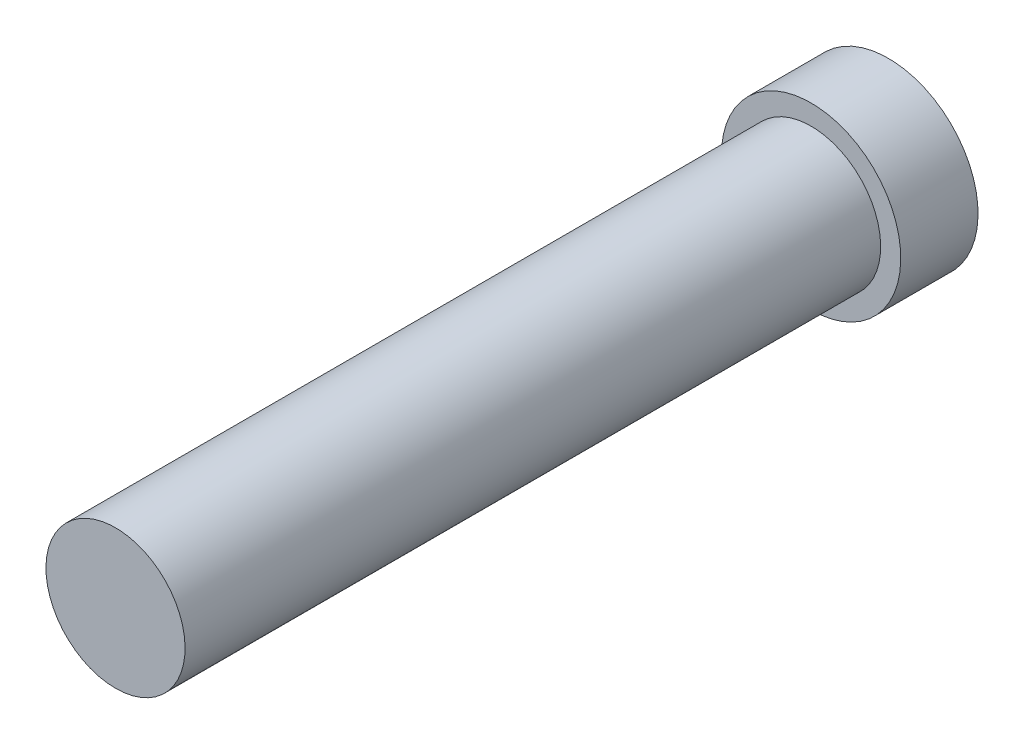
ISO-10303-21;
HEADER;
FILE_DESCRIPTION(('STEP AP214'),'2;1');
FILE_NAME('part.step','',(''),(''),'','','');
FILE_SCHEMA(('AUTOMOTIVE_DESIGN { 1 0 10303 214 1 1 1 1 }'));
ENDSEC;
DATA;
#1=APPLICATION_CONTEXT('core data for automotive mechanical design processes');
#2=APPLICATION_PROTOCOL_DEFINITION('international standard','automotive_design',2000,#1);
#3=PRODUCT_CONTEXT('',#1,'mechanical');
#4=PRODUCT('Part','Part','',(#3));
#5=PRODUCT_RELATED_PRODUCT_CATEGORY('part','',(#4));
#6=PRODUCT_DEFINITION_FORMATION('','',#4);
#7=PRODUCT_DEFINITION_CONTEXT('part definition',#1,'design');
#8=PRODUCT_DEFINITION('design','',#6,#7);
#9=PRODUCT_DEFINITION_SHAPE('','',#8);
#10=(LENGTH_UNIT() NAMED_UNIT(*) SI_UNIT(.MILLI.,.METRE.));
#11=(NAMED_UNIT(*) PLANE_ANGLE_UNIT() SI_UNIT($,.RADIAN.));
#12=(NAMED_UNIT(*) SI_UNIT($,.STERADIAN.) SOLID_ANGLE_UNIT());
#13=UNCERTAINTY_MEASURE_WITH_UNIT(LENGTH_MEASURE(1.E-05),#10,'distance_accuracy_value','');
#14=(GEOMETRIC_REPRESENTATION_CONTEXT(3) GLOBAL_UNCERTAINTY_ASSIGNED_CONTEXT((#13)) GLOBAL_UNIT_ASSIGNED_CONTEXT((#10,
#11,#12)) REPRESENTATION_CONTEXT('',''));
#15=CARTESIAN_POINT('',(0.,0.,0.));
#16=DIRECTION('',(0.,0.,1.));
#17=DIRECTION('',(1.,0.,0.));
#18=AXIS2_PLACEMENT_3D('',#15,#16,#17);
#19=CARTESIAN_POINT('',(0.,0.,-25.));
#20=DIRECTION('',(0.,0.,1.));
#21=DIRECTION('',(0.,-1.,0.));
#22=AXIS2_PLACEMENT_3D('',#19,#20,#21);
#23=PLANE('',#22);
#24=DIRECTION('',(-0.866025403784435,-0.500000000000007,0.));
#25=VECTOR('',#24,1.);
#26=CARTESIAN_POINT('',(1.34903810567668,-2.33660254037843,-25.));
#27=LINE('',#26,#25);
#28=CARTESIAN_POINT('',(0.,-3.11547005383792,-25.));
#29=VERTEX_POINT('',#28);
#30=CARTESIAN_POINT('',(2.69807621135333,-1.55773502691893,-25.));
#31=VERTEX_POINT('',#30);
#32=EDGE_CURVE('E184',#29,#31,#27,.F.);
#33=ORIENTED_EDGE('',*,*,#32,.T.);
#34=DIRECTION('',(0.,-1.,0.));
#35=VECTOR('',#34,1.);
#36=CARTESIAN_POINT('',(2.69807621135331,0.,-25.));
#37=LINE('',#36,#35);
#38=CARTESIAN_POINT('',(2.6980762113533,1.557735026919,-25.));
#39=VERTEX_POINT('',#38);
#40=EDGE_CURVE('E148',#31,#39,#37,.F.);
#41=ORIENTED_EDGE('',*,*,#40,.T.);
#42=DIRECTION('',(0.866025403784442,-0.499999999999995,0.));
#43=VECTOR('',#42,1.);
#44=CARTESIAN_POINT('',(1.34903810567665,2.33660254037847,-25.));
#45=LINE('',#44,#43);
#46=CARTESIAN_POINT('',(0.,3.11547005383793,-25.));
#47=VERTEX_POINT('',#46);
#48=EDGE_CURVE('E164',#39,#47,#45,.F.);
#49=ORIENTED_EDGE('',*,*,#48,.T.);
#50=DIRECTION('',(0.866025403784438,0.500000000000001,0.));
#51=VECTOR('',#50,1.);
#52=CARTESIAN_POINT('',(-1.34903810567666,2.33660254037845,-25.));
#53=LINE('',#52,#51);
#54=CARTESIAN_POINT('',(-2.69807621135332,1.55773502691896,-25.));
#55=VERTEX_POINT('',#54);
#56=EDGE_CURVE('E169',#47,#55,#53,.F.);
#57=ORIENTED_EDGE('',*,*,#56,.T.);
#58=DIRECTION('',(0.,1.,0.));
#59=VECTOR('',#58,1.);
#60=CARTESIAN_POINT('',(-2.69807621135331,0.,-25.));
#61=LINE('',#60,#59);
#62=CARTESIAN_POINT('',(-2.69807621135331,-1.55773502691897,-25.));
#63=VERTEX_POINT('',#62);
#64=EDGE_CURVE('E178',#55,#63,#61,.F.);
#65=ORIENTED_EDGE('',*,*,#64,.T.);
#66=DIRECTION('',(-0.866025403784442,0.499999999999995,0.));
#67=VECTOR('',#66,1.);
#68=CARTESIAN_POINT('',(-1.34903810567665,-2.33660254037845,-25.));
#69=LINE('',#68,#67);
#70=EDGE_CURVE('E181',#63,#29,#69,.F.);
#71=ORIENTED_EDGE('',*,*,#70,.T.);
#72=EDGE_LOOP('',(#33,#41,#49,#57,#65,#71));
#73=FACE_BOUND('',#72,.T.);
#74=CARTESIAN_POINT('',(0.,0.,-25.));
#75=DIRECTION('',(0.,0.,1.));
#76=DIRECTION('',(0.,-1.,0.));
#77=AXIS2_PLACEMENT_3D('',#74,#75,#76);
#78=CIRCLE('',#77,5.8);
#79=CARTESIAN_POINT('',(0.,-5.79999999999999,-25.));
#80=VERTEX_POINT('',#79);
#81=EDGE_CURVE('E165',#80,#80,#78,.T.);
#82=ORIENTED_EDGE('',*,*,#81,.F.);
#83=EDGE_LOOP('',(#82));
#84=FACE_BOUND('',#83,.T.);
#85=ADVANCED_FACE('F39',(#73,#84),#23,.F.);
#86=CARTESIAN_POINT('',(0.,0.,25.));
#87=DIRECTION('',(0.,0.,1.));
#88=DIRECTION('',(0.,-1.,0.));
#89=AXIS2_PLACEMENT_3D('',#86,#87,#88);
#90=CYLINDRICAL_SURFACE('',#89,5.8);
#91=CARTESIAN_POINT('',(0.,0.,-20.));
#92=DIRECTION('',(0.,0.,1.));
#93=DIRECTION('',(0.,-1.,0.));
#94=AXIS2_PLACEMENT_3D('',#91,#92,#93);
#95=CIRCLE('',#94,5.8);
#96=CARTESIAN_POINT('',(0.,-5.79999999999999,-20.));
#97=VERTEX_POINT('',#96);
#98=EDGE_CURVE('E172',#97,#97,#95,.T.);
#99=ORIENTED_EDGE('',*,*,#98,.F.);
#100=EDGE_LOOP('',(#99));
#101=FACE_BOUND('',#100,.T.);
#102=ORIENTED_EDGE('',*,*,#81,.T.);
#103=EDGE_LOOP('',(#102));
#104=FACE_BOUND('',#103,.T.);
#105=ADVANCED_FACE('F337',(#101,#104),#90,.T.);
#106=CARTESIAN_POINT('',(0.,5.80000000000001,-20.));
#107=DIRECTION('',(0.,0.,-1.));
#108=DIRECTION('',(0.,1.,0.));
#109=AXIS2_PLACEMENT_3D('',#106,#107,#108);
#110=PLANE('',#109);
#111=CARTESIAN_POINT('',(0.,0.,-20.));
#112=DIRECTION('',(0.,0.,1.));
#113=DIRECTION('',(0.,-1.,0.));
#114=AXIS2_PLACEMENT_3D('',#111,#112,#113);
#115=CIRCLE('',#114,4.49999999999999);
#116=CARTESIAN_POINT('',(0.,-4.49999999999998,-20.));
#117=VERTEX_POINT('',#116);
#118=EDGE_CURVE('E321',#117,#117,#115,.T.);
#119=ORIENTED_EDGE('',*,*,#118,.F.);
#120=EDGE_LOOP('',(#119));
#121=FACE_BOUND('',#120,.T.);
#122=ORIENTED_EDGE('',*,*,#98,.T.);
#123=EDGE_LOOP('',(#122));
#124=FACE_BOUND('',#123,.T.);
#125=ADVANCED_FACE('F335',(#121,#124),#110,.F.);
#126=CARTESIAN_POINT('',(0.,0.,25.));
#127=DIRECTION('',(0.,0.,1.));
#128=DIRECTION('',(0.,-1.,0.));
#129=AXIS2_PLACEMENT_3D('',#126,#127,#128);
#130=CYLINDRICAL_SURFACE('',#129,4.49999999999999);
#131=CARTESIAN_POINT('',(0.,0.,25.));
#132=DIRECTION('',(0.,0.,1.));
#133=DIRECTION('',(0.,-1.,0.));
#134=AXIS2_PLACEMENT_3D('',#131,#132,#133);
#135=CIRCLE('',#134,4.49999999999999);
#136=CARTESIAN_POINT('',(0.,-4.49999999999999,25.));
#137=VERTEX_POINT('',#136);
#138=EDGE_CURVE('E316',#137,#137,#135,.T.);
#139=ORIENTED_EDGE('',*,*,#138,.F.);
#140=EDGE_LOOP('',(#139));
#141=FACE_BOUND('',#140,.T.);
#142=ORIENTED_EDGE('',*,*,#118,.T.);
#143=EDGE_LOOP('',(#142));
#144=FACE_BOUND('',#143,.T.);
#145=ADVANCED_FACE('F458',(#141,#144),#130,.T.);
#146=CARTESIAN_POINT('',(0.,4.49999999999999,25.));
#147=DIRECTION('',(0.,0.,-1.));
#148=DIRECTION('',(0.,1.,0.));
#149=AXIS2_PLACEMENT_3D('',#146,#147,#148);
#150=PLANE('',#149);
#151=ORIENTED_EDGE('',*,*,#138,.T.);
#152=EDGE_LOOP('',(#151));
#153=FACE_BOUND('',#152,.T.);
#154=ADVANCED_FACE('F451',(#153),#150,.F.);
#155=CARTESIAN_POINT('',(-2.59807621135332,1.5,-22.));
#156=DIRECTION('',(-1.,0.,0.));
#157=DIRECTION('',(0.,-1.,0.));
#158=AXIS2_PLACEMENT_3D('',#155,#156,#157);
#159=PLANE('',#158);
#160=DIRECTION('',(0.,0.,-1.));
#161=VECTOR('',#160,1.);
#162=CARTESIAN_POINT('',(-2.59807621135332,1.5,-22.));
#163=LINE('',#162,#161);
#164=CARTESIAN_POINT('',(-2.59807621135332,1.5,-22.1));
#165=VERTEX_POINT('',#164);
#166=CARTESIAN_POINT('',(-2.59807621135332,1.5,-24.9));
#167=VERTEX_POINT('',#166);
#168=EDGE_CURVE('E220',#165,#167,#163,.T.);
#169=ORIENTED_EDGE('',*,*,#168,.F.);
#170=DIRECTION('',(0.,1.,0.));
#171=VECTOR('',#170,1.);
#172=CARTESIAN_POINT('',(-2.59807621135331,-1.50000000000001,-22.1));
#173=LINE('',#172,#171);
#174=CARTESIAN_POINT('',(-2.59807621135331,-1.50000000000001,-22.1));
#175=VERTEX_POINT('',#174);
#176=EDGE_CURVE('E243',#165,#175,#173,.F.);
#177=ORIENTED_EDGE('',*,*,#176,.T.);
#178=DIRECTION('',(0.,0.,-1.));
#179=VECTOR('',#178,1.);
#180=CARTESIAN_POINT('',(-2.59807621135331,-1.50000000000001,-22.));
#181=LINE('',#180,#179);
#182=CARTESIAN_POINT('',(-2.59807621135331,-1.50000000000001,-24.9));
#183=VERTEX_POINT('',#182);
#184=EDGE_CURVE('E311',#175,#183,#181,.T.);
#185=ORIENTED_EDGE('',*,*,#184,.T.);
#186=DIRECTION('',(0.,1.,0.));
#187=VECTOR('',#186,1.);
#188=CARTESIAN_POINT('',(-2.59807621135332,1.5,-24.9));
#189=LINE('',#188,#187);
#190=EDGE_CURVE('E192',#183,#167,#189,.T.);
#191=ORIENTED_EDGE('',*,*,#190,.T.);
#192=EDGE_LOOP('',(#169,#177,#185,#191));
#193=FACE_BOUND('',#192,.T.);
#194=ADVANCED_FACE('F310',(#193),#159,.F.);
#195=CARTESIAN_POINT('',(-2.59807621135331,-1.50000000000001,-22.));
#196=DIRECTION('',(-0.499999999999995,-0.866025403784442,0.));
#197=DIRECTION('',(0.866025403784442,-0.499999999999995,0.));
#198=AXIS2_PLACEMENT_3D('',#195,#196,#197);
#199=PLANE('',#198);
#200=ORIENTED_EDGE('',*,*,#184,.F.);
#201=DIRECTION('',(-0.866025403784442,0.499999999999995,0.));
#202=VECTOR('',#201,1.);
#203=CARTESIAN_POINT('',(0.,-3.,-22.1));
#204=LINE('',#203,#202);
#205=CARTESIAN_POINT('',(0.,-3.,-22.1));
#206=VERTEX_POINT('',#205);
#207=EDGE_CURVE('E246',#175,#206,#204,.F.);
#208=ORIENTED_EDGE('',*,*,#207,.T.);
#209=DIRECTION('',(0.,0.,-1.));
#210=VECTOR('',#209,1.);
#211=CARTESIAN_POINT('',(0.,-3.,-22.));
#212=LINE('',#211,#210);
#213=CARTESIAN_POINT('',(0.,-3.,-24.9));
#214=VERTEX_POINT('',#213);
#215=EDGE_CURVE('E137',#206,#214,#212,.T.);
#216=ORIENTED_EDGE('',*,*,#215,.T.);
#217=DIRECTION('',(-0.866025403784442,0.499999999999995,0.));
#218=VECTOR('',#217,1.);
#219=CARTESIAN_POINT('',(-2.59807621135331,-1.50000000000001,-24.9));
#220=LINE('',#219,#218);
#221=EDGE_CURVE('E159',#214,#183,#220,.T.);
#222=ORIENTED_EDGE('',*,*,#221,.T.);
#223=EDGE_LOOP('',(#200,#208,#216,#222));
#224=FACE_BOUND('',#223,.T.);
#225=ADVANCED_FACE('F313',(#224),#199,.F.);
#226=CARTESIAN_POINT('',(0.,-3.,-22.));
#227=DIRECTION('',(0.500000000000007,-0.866025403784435,0.));
#228=DIRECTION('',(0.866025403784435,0.500000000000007,0.));
#229=AXIS2_PLACEMENT_3D('',#226,#227,#228);
#230=PLANE('',#229);
#231=ORIENTED_EDGE('',*,*,#215,.F.);
#232=DIRECTION('',(-0.866025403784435,-0.500000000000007,0.));
#233=VECTOR('',#232,1.);
#234=CARTESIAN_POINT('',(2.59807621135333,-1.49999999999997,-22.1));
#235=LINE('',#234,#233);
#236=CARTESIAN_POINT('',(2.59807621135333,-1.49999999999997,-22.1));
#237=VERTEX_POINT('',#236);
#238=EDGE_CURVE('E64',#206,#237,#235,.F.);
#239=ORIENTED_EDGE('',*,*,#238,.T.);
#240=DIRECTION('',(0.,0.,-1.));
#241=VECTOR('',#240,1.);
#242=CARTESIAN_POINT('',(2.59807621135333,-1.49999999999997,-22.));
#243=LINE('',#242,#241);
#244=CARTESIAN_POINT('',(2.59807621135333,-1.49999999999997,-24.9));
#245=VERTEX_POINT('',#244);
#246=EDGE_CURVE('E128',#237,#245,#243,.T.);
#247=ORIENTED_EDGE('',*,*,#246,.T.);
#248=DIRECTION('',(-0.866025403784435,-0.500000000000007,0.));
#249=VECTOR('',#248,1.);
#250=CARTESIAN_POINT('',(0.,-3.,-24.9));
#251=LINE('',#250,#249);
#252=EDGE_CURVE('E132',#245,#214,#251,.T.);
#253=ORIENTED_EDGE('',*,*,#252,.T.);
#254=EDGE_LOOP('',(#231,#239,#247,#253));
#255=FACE_BOUND('',#254,.T.);
#256=ADVANCED_FACE('F130',(#255),#230,.F.);
#257=CARTESIAN_POINT('',(2.59807621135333,-1.49999999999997,-22.));
#258=DIRECTION('',(1.,0.,0.));
#259=DIRECTION('',(0.,1.,0.));
#260=AXIS2_PLACEMENT_3D('',#257,#258,#259);
#261=PLANE('',#260);
#262=ORIENTED_EDGE('',*,*,#246,.F.);
#263=DIRECTION('',(0.,-1.,0.));
#264=VECTOR('',#263,1.);
#265=CARTESIAN_POINT('',(2.5980762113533,1.50000000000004,-22.1));
#266=LINE('',#265,#264);
#267=CARTESIAN_POINT('',(2.5980762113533,1.50000000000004,-22.1));
#268=VERTEX_POINT('',#267);
#269=EDGE_CURVE('E49',#237,#268,#266,.F.);
#270=ORIENTED_EDGE('',*,*,#269,.T.);
#271=DIRECTION('',(0.,0.,-1.));
#272=VECTOR('',#271,1.);
#273=CARTESIAN_POINT('',(2.5980762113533,1.50000000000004,-22.));
#274=LINE('',#273,#272);
#275=CARTESIAN_POINT('',(2.5980762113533,1.50000000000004,-24.9));
#276=VERTEX_POINT('',#275);
#277=EDGE_CURVE('E138',#268,#276,#274,.T.);
#278=ORIENTED_EDGE('',*,*,#277,.T.);
#279=DIRECTION('',(0.,-1.,0.));
#280=VECTOR('',#279,1.);
#281=CARTESIAN_POINT('',(2.59807621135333,-1.49999999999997,-24.9));
#282=LINE('',#281,#280);
#283=EDGE_CURVE('E146',#276,#245,#282,.T.);
#284=ORIENTED_EDGE('',*,*,#283,.T.);
#285=EDGE_LOOP('',(#262,#270,#278,#284));
#286=FACE_BOUND('',#285,.T.);
#287=ADVANCED_FACE('F161',(#286),#261,.F.);
#288=CARTESIAN_POINT('',(2.5980762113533,1.50000000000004,-22.));
#289=DIRECTION('',(0.499999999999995,0.866025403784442,0.));
#290=DIRECTION('',(-0.866025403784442,0.499999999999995,0.));
#291=AXIS2_PLACEMENT_3D('',#288,#289,#290);
#292=PLANE('',#291);
#293=ORIENTED_EDGE('',*,*,#277,.F.);
#294=DIRECTION('',(0.866025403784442,-0.499999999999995,0.));
#295=VECTOR('',#294,1.);
#296=CARTESIAN_POINT('',(0.,3.00000000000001,-22.1));
#297=LINE('',#296,#295);
#298=CARTESIAN_POINT('',(0.,3.00000000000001,-22.1));
#299=VERTEX_POINT('',#298);
#300=EDGE_CURVE('E11',#268,#299,#297,.F.);
#301=ORIENTED_EDGE('',*,*,#300,.T.);
#302=DIRECTION('',(0.,0.,-1.));
#303=VECTOR('',#302,1.);
#304=CARTESIAN_POINT('',(0.,3.00000000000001,-22.));
#305=LINE('',#304,#303);
#306=CARTESIAN_POINT('',(0.,3.00000000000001,-24.9));
#307=VERTEX_POINT('',#306);
#308=EDGE_CURVE('E291',#299,#307,#305,.T.);
#309=ORIENTED_EDGE('',*,*,#308,.T.);
#310=DIRECTION('',(0.866025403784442,-0.499999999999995,0.));
#311=VECTOR('',#310,1.);
#312=CARTESIAN_POINT('',(2.5980762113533,1.50000000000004,-24.9));
#313=LINE('',#312,#311);
#314=EDGE_CURVE('E200',#307,#276,#313,.T.);
#315=ORIENTED_EDGE('',*,*,#314,.T.);
#316=EDGE_LOOP('',(#293,#301,#309,#315));
#317=FACE_BOUND('',#316,.T.);
#318=ADVANCED_FACE('F290',(#317),#292,.F.);
#319=CARTESIAN_POINT('',(0.,3.00000000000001,-22.));
#320=DIRECTION('',(-0.500000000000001,0.866025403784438,0.));
#321=DIRECTION('',(-0.866025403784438,-0.500000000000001,0.));
#322=AXIS2_PLACEMENT_3D('',#319,#320,#321);
#323=PLANE('',#322);
#324=ORIENTED_EDGE('',*,*,#308,.F.);
#325=DIRECTION('',(0.866025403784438,0.500000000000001,0.));
#326=VECTOR('',#325,1.);
#327=CARTESIAN_POINT('',(-2.59807621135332,1.5,-22.1));
#328=LINE('',#327,#326);
#329=EDGE_CURVE('E239',#299,#165,#328,.F.);
#330=ORIENTED_EDGE('',*,*,#329,.T.);
#331=ORIENTED_EDGE('',*,*,#168,.T.);
#332=DIRECTION('',(0.866025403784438,0.500000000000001,0.));
#333=VECTOR('',#332,1.);
#334=CARTESIAN_POINT('',(0.,3.00000000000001,-24.9));
#335=LINE('',#334,#333);
#336=EDGE_CURVE('E196',#167,#307,#335,.T.);
#337=ORIENTED_EDGE('',*,*,#336,.T.);
#338=EDGE_LOOP('',(#324,#330,#331,#337));
#339=FACE_BOUND('',#338,.T.);
#340=ADVANCED_FACE('F294',(#339),#323,.F.);
#341=CARTESIAN_POINT('',(0.,0.,-22.));
#342=DIRECTION('',(0.,0.,1.));
#343=DIRECTION('',(1.,0.,0.));
#344=AXIS2_PLACEMENT_3D('',#341,#342,#343);
#345=PLANE('',#344);
#346=DIRECTION('',(0.,1.,0.));
#347=VECTOR('',#346,1.);
#348=CARTESIAN_POINT('',(-2.49807621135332,1.5,-22.));
#349=LINE('',#348,#347);
#350=CARTESIAN_POINT('',(-2.49807621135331,-1.44226497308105,-22.));
#351=VERTEX_POINT('',#350);
#352=CARTESIAN_POINT('',(-2.49807621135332,1.44226497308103,-22.));
#353=VERTEX_POINT('',#352);
#354=EDGE_CURVE('E232',#351,#353,#349,.T.);
#355=ORIENTED_EDGE('',*,*,#354,.T.);
#356=DIRECTION('',(0.866025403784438,0.500000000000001,0.));
#357=VECTOR('',#356,1.);
#358=CARTESIAN_POINT('',(0.0500000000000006,2.91339745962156,-22.));
#359=LINE('',#358,#357);
#360=CARTESIAN_POINT('',(0.,2.88452994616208,-22.));
#361=VERTEX_POINT('',#360);
#362=EDGE_CURVE('E235',#353,#361,#359,.T.);
#363=ORIENTED_EDGE('',*,*,#362,.T.);
#364=DIRECTION('',(0.866025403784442,-0.499999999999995,0.));
#365=VECTOR('',#364,1.);
#366=CARTESIAN_POINT('',(2.5480762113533,1.41339745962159,-22.));
#367=LINE('',#366,#365);
#368=CARTESIAN_POINT('',(2.4980762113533,1.44226497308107,-22.));
#369=VERTEX_POINT('',#368);
#370=EDGE_CURVE('E202',#361,#369,#367,.T.);
#371=ORIENTED_EDGE('',*,*,#370,.T.);
#372=DIRECTION('',(0.,-1.,0.));
#373=VECTOR('',#372,1.);
#374=CARTESIAN_POINT('',(2.49807621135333,-1.49999999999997,-22.));
#375=LINE('',#374,#373);
#376=CARTESIAN_POINT('',(2.49807621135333,-1.44226497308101,-22.));
#377=VERTEX_POINT('',#376);
#378=EDGE_CURVE('E223',#369,#377,#375,.T.);
#379=ORIENTED_EDGE('',*,*,#378,.T.);
#380=DIRECTION('',(-0.866025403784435,-0.500000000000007,0.));
#381=VECTOR('',#380,1.);
#382=CARTESIAN_POINT('',(-0.04999999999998,-2.91339745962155,-22.));
#383=LINE('',#382,#381);
#384=CARTESIAN_POINT('',(0.,-2.88452994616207,-22.));
#385=VERTEX_POINT('',#384);
#386=EDGE_CURVE('E226',#377,#385,#383,.T.);
#387=ORIENTED_EDGE('',*,*,#386,.T.);
#388=DIRECTION('',(-0.866025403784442,0.499999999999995,0.));
#389=VECTOR('',#388,1.);
#390=CARTESIAN_POINT('',(-2.54807621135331,-1.41339745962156,-22.));
#391=LINE('',#390,#389);
#392=EDGE_CURVE('E229',#385,#351,#391,.T.);
#393=ORIENTED_EDGE('',*,*,#392,.T.);
#394=EDGE_LOOP('',(#355,#363,#371,#379,#387,#393));
#395=FACE_BOUND('',#394,.T.);
#396=ADVANCED_FACE('F369',(#395),#345,.F.);
#397=CARTESIAN_POINT('',(-2.69807621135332,1.5,-24.9));
#398=DIRECTION('',(0.,1.,0.));
#399=DIRECTION('',(-1.,0.,0.));
#400=AXIS2_PLACEMENT_3D('',#397,#398,#399);
#401=CYLINDRICAL_SURFACE('',#400,0.1);
#402=CARTESIAN_POINT('',(-2.69807621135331,-1.55773502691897,-24.9));
#403=DIRECTION('',(-0.500000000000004,0.866025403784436,0.));
#404=DIRECTION('',(-0.866025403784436,-0.500000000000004,0.));
#405=AXIS2_PLACEMENT_3D('',#402,#403,#404);
#406=ELLIPSE('',#405,0.115470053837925,0.1);
#407=EDGE_CURVE('E212',#63,#183,#406,.F.);
#408=ORIENTED_EDGE('',*,*,#407,.F.);
#409=ORIENTED_EDGE('',*,*,#64,.F.);
#410=CARTESIAN_POINT('',(-2.69807621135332,1.55773502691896,-24.9));
#411=DIRECTION('',(0.499999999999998,0.86602540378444,0.));
#412=DIRECTION('',(-0.86602540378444,0.499999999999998,0.));
#413=AXIS2_PLACEMENT_3D('',#410,#411,#412);
#414=ELLIPSE('',#413,0.115470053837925,0.1);
#415=EDGE_CURVE('E216',#167,#55,#414,.T.);
#416=ORIENTED_EDGE('',*,*,#415,.F.);
#417=ORIENTED_EDGE('',*,*,#190,.F.);
#418=EDGE_LOOP('',(#408,#409,#416,#417));
#419=FACE_BOUND('',#418,.T.);
#420=ADVANCED_FACE('F365',(#419),#401,.T.);
#421=CARTESIAN_POINT('',(-0.0499999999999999,3.08660254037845,-24.9));
#422=DIRECTION('',(0.866025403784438,0.500000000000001,0.));
#423=DIRECTION('',(-0.500000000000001,0.866025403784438,0.));
#424=AXIS2_PLACEMENT_3D('',#421,#422,#423);
#425=CYLINDRICAL_SURFACE('',#424,0.1);
#426=ORIENTED_EDGE('',*,*,#415,.T.);
#427=ORIENTED_EDGE('',*,*,#56,.F.);
#428=CARTESIAN_POINT('',(0.,3.11547005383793,-24.9));
#429=DIRECTION('',(1.,0.,0.));
#430=DIRECTION('',(0.,1.,0.));
#431=AXIS2_PLACEMENT_3D('',#428,#429,#430);
#432=ELLIPSE('',#431,0.115470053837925,0.1);
#433=EDGE_CURVE('E208',#307,#47,#432,.T.);
#434=ORIENTED_EDGE('',*,*,#433,.F.);
#435=ORIENTED_EDGE('',*,*,#336,.F.);
#436=EDGE_LOOP('',(#426,#427,#434,#435));
#437=FACE_BOUND('',#436,.T.);
#438=ADVANCED_FACE('F361',(#437),#425,.T.);
#439=CARTESIAN_POINT('',(-2.64807621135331,-1.58660254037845,-24.9));
#440=DIRECTION('',(-0.866025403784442,0.499999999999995,0.));
#441=DIRECTION('',(-0.499999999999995,-0.866025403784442,0.));
#442=AXIS2_PLACEMENT_3D('',#439,#440,#441);
#443=CYLINDRICAL_SURFACE('',#442,0.1);
#444=ORIENTED_EDGE('',*,*,#407,.T.);
#445=ORIENTED_EDGE('',*,*,#221,.F.);
#446=CARTESIAN_POINT('',(0.,-3.11547005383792,-24.9));
#447=DIRECTION('',(-1.,0.,0.));
#448=DIRECTION('',(0.,-1.,0.));
#449=AXIS2_PLACEMENT_3D('',#446,#447,#448);
#450=ELLIPSE('',#449,0.115470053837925,0.1);
#451=EDGE_CURVE('E157',#29,#214,#450,.F.);
#452=ORIENTED_EDGE('',*,*,#451,.F.);
#453=ORIENTED_EDGE('',*,*,#70,.F.);
#454=EDGE_LOOP('',(#444,#445,#452,#453));
#455=FACE_BOUND('',#454,.T.);
#456=ADVANCED_FACE('F357',(#455),#443,.T.);
#457=CARTESIAN_POINT('',(2.6480762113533,1.58660254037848,-24.9));
#458=DIRECTION('',(0.866025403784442,-0.499999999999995,0.));
#459=DIRECTION('',(0.499999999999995,0.866025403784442,0.));
#460=AXIS2_PLACEMENT_3D('',#457,#458,#459);
#461=CYLINDRICAL_SURFACE('',#460,0.1);
#462=ORIENTED_EDGE('',*,*,#433,.T.);
#463=ORIENTED_EDGE('',*,*,#48,.F.);
#464=CARTESIAN_POINT('',(2.6980762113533,1.557735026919,-24.9));
#465=DIRECTION('',(0.500000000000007,-0.866025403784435,0.));
#466=DIRECTION('',(-0.866025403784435,-0.500000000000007,0.));
#467=AXIS2_PLACEMENT_3D('',#464,#465,#466);
#468=ELLIPSE('',#467,0.115470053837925,0.1);
#469=EDGE_CURVE('E152',#276,#39,#468,.T.);
#470=ORIENTED_EDGE('',*,*,#469,.F.);
#471=ORIENTED_EDGE('',*,*,#314,.F.);
#472=EDGE_LOOP('',(#462,#463,#470,#471));
#473=FACE_BOUND('',#472,.T.);
#474=ADVANCED_FACE('F354',(#473),#461,.T.);
#475=CARTESIAN_POINT('',(0.0500000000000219,-3.08660254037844,-24.9));
#476=DIRECTION('',(-0.866025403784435,-0.500000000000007,0.));
#477=DIRECTION('',(0.500000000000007,-0.866025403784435,0.));
#478=AXIS2_PLACEMENT_3D('',#475,#476,#477);
#479=CYLINDRICAL_SURFACE('',#478,0.1);
#480=ORIENTED_EDGE('',*,*,#451,.T.);
#481=ORIENTED_EDGE('',*,*,#252,.F.);
#482=CARTESIAN_POINT('',(2.69807621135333,-1.55773502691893,-24.9));
#483=DIRECTION('',(-0.499999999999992,-0.866025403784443,0.));
#484=DIRECTION('',(0.866025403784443,-0.499999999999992,0.));
#485=AXIS2_PLACEMENT_3D('',#482,#483,#484);
#486=ELLIPSE('',#485,0.115470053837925,0.1);
#487=EDGE_CURVE('E144',#31,#245,#486,.F.);
#488=ORIENTED_EDGE('',*,*,#487,.F.);
#489=ORIENTED_EDGE('',*,*,#32,.F.);
#490=EDGE_LOOP('',(#480,#481,#488,#489));
#491=FACE_BOUND('',#490,.T.);
#492=ADVANCED_FACE('F155',(#491),#479,.T.);
#493=CARTESIAN_POINT('',(2.69807621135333,-1.49999999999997,-24.9));
#494=DIRECTION('',(0.,-1.,0.));
#495=DIRECTION('',(1.,0.,0.));
#496=AXIS2_PLACEMENT_3D('',#493,#494,#495);
#497=CYLINDRICAL_SURFACE('',#496,0.1);
#498=ORIENTED_EDGE('',*,*,#469,.T.);
#499=ORIENTED_EDGE('',*,*,#40,.F.);
#500=ORIENTED_EDGE('',*,*,#487,.T.);
#501=ORIENTED_EDGE('',*,*,#283,.F.);
#502=EDGE_LOOP('',(#498,#499,#500,#501));
#503=FACE_BOUND('',#502,.T.);
#504=ADVANCED_FACE('F145',(#503),#497,.T.);
#505=CARTESIAN_POINT('',(1.24903810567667,-2.16339745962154,-22.1));
#506=DIRECTION('',(0.866025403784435,0.500000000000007,0.));
#507=DIRECTION('',(-0.500000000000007,0.866025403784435,0.));
#508=AXIS2_PLACEMENT_3D('',#505,#506,#507);
#509=CYLINDRICAL_SURFACE('',#508,0.1);
#510=CARTESIAN_POINT('',(2.49807621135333,-1.44226497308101,-22.1));
#511=DIRECTION('',(0.499999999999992,0.866025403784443,0.));
#512=DIRECTION('',(0.866025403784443,-0.499999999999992,0.));
#513=AXIS2_PLACEMENT_3D('',#510,#511,#512);
#514=ELLIPSE('',#513,0.115470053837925,0.1);
#515=EDGE_CURVE('E266',#237,#377,#514,.F.);
#516=ORIENTED_EDGE('',*,*,#515,.F.);
#517=ORIENTED_EDGE('',*,*,#238,.F.);
#518=CARTESIAN_POINT('',(0.,-2.88452994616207,-22.1));
#519=DIRECTION('',(1.,0.,0.));
#520=DIRECTION('',(0.,-1.,0.));
#521=AXIS2_PLACEMENT_3D('',#518,#519,#520);
#522=ELLIPSE('',#521,0.115470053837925,0.1);
#523=EDGE_CURVE('E43',#385,#206,#522,.T.);
#524=ORIENTED_EDGE('',*,*,#523,.F.);
#525=ORIENTED_EDGE('',*,*,#386,.F.);
#526=EDGE_LOOP('',(#516,#517,#524,#525));
#527=FACE_BOUND('',#526,.T.);
#528=ADVANCED_FACE('F41',(#527),#509,.F.);
#529=CARTESIAN_POINT('',(-1.24903810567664,-2.16339745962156,-22.1));
#530=DIRECTION('',(0.866025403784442,-0.499999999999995,0.));
#531=DIRECTION('',(0.499999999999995,0.866025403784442,0.));
#532=AXIS2_PLACEMENT_3D('',#529,#530,#531);
#533=CYLINDRICAL_SURFACE('',#532,0.1);
#534=ORIENTED_EDGE('',*,*,#523,.T.);
#535=ORIENTED_EDGE('',*,*,#207,.F.);
#536=CARTESIAN_POINT('',(-2.49807621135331,-1.44226497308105,-22.1));
#537=DIRECTION('',(0.500000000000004,-0.866025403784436,0.));
#538=DIRECTION('',(-0.866025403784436,-0.500000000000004,0.));
#539=AXIS2_PLACEMENT_3D('',#536,#537,#538);
#540=ELLIPSE('',#539,0.115470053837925,0.1);
#541=EDGE_CURVE('E263',#351,#175,#540,.T.);
#542=ORIENTED_EDGE('',*,*,#541,.F.);
#543=ORIENTED_EDGE('',*,*,#392,.F.);
#544=EDGE_LOOP('',(#534,#535,#542,#543));
#545=FACE_BOUND('',#544,.T.);
#546=ADVANCED_FACE('F277',(#545),#533,.F.);
#547=CARTESIAN_POINT('',(2.49807621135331,0.,-22.1));
#548=DIRECTION('',(0.,1.,0.));
#549=DIRECTION('',(-1.,0.,0.));
#550=AXIS2_PLACEMENT_3D('',#547,#548,#549);
#551=CYLINDRICAL_SURFACE('',#550,0.1);
#552=ORIENTED_EDGE('',*,*,#515,.T.);
#553=ORIENTED_EDGE('',*,*,#378,.F.);
#554=CARTESIAN_POINT('',(2.4980762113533,1.44226497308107,-22.1));
#555=DIRECTION('',(-0.500000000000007,0.866025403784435,0.));
#556=DIRECTION('',(0.866025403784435,0.500000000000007,0.));
#557=AXIS2_PLACEMENT_3D('',#554,#555,#556);
#558=ELLIPSE('',#557,0.115470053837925,0.1);
#559=EDGE_CURVE('E259',#268,#369,#558,.F.);
#560=ORIENTED_EDGE('',*,*,#559,.F.);
#561=ORIENTED_EDGE('',*,*,#269,.F.);
#562=EDGE_LOOP('',(#552,#553,#560,#561));
#563=FACE_BOUND('',#562,.T.);
#564=ADVANCED_FACE('F282',(#563),#551,.F.);
#565=CARTESIAN_POINT('',(-2.49807621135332,0.,-22.1));
#566=DIRECTION('',(0.,-1.,0.));
#567=DIRECTION('',(1.,0.,0.));
#568=AXIS2_PLACEMENT_3D('',#565,#566,#567);
#569=CYLINDRICAL_SURFACE('',#568,0.1);
#570=ORIENTED_EDGE('',*,*,#541,.T.);
#571=ORIENTED_EDGE('',*,*,#176,.F.);
#572=CARTESIAN_POINT('',(-2.49807621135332,1.44226497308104,-22.1));
#573=DIRECTION('',(-0.499999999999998,-0.86602540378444,0.));
#574=DIRECTION('',(-0.86602540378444,0.499999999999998,0.));
#575=AXIS2_PLACEMENT_3D('',#572,#573,#574);
#576=ELLIPSE('',#575,0.115470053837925,0.1);
#577=EDGE_CURVE('E256',#353,#165,#576,.T.);
#578=ORIENTED_EDGE('',*,*,#577,.F.);
#579=ORIENTED_EDGE('',*,*,#354,.F.);
#580=EDGE_LOOP('',(#570,#571,#578,#579));
#581=FACE_BOUND('',#580,.T.);
#582=ADVANCED_FACE('F307',(#581),#569,.F.);
#583=CARTESIAN_POINT('',(1.24903810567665,2.16339745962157,-22.1));
#584=DIRECTION('',(-0.866025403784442,0.499999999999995,0.));
#585=DIRECTION('',(-0.499999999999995,-0.866025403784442,0.));
#586=AXIS2_PLACEMENT_3D('',#583,#584,#585);
#587=CYLINDRICAL_SURFACE('',#586,0.1);
#588=ORIENTED_EDGE('',*,*,#559,.T.);
#589=ORIENTED_EDGE('',*,*,#370,.F.);
#590=CARTESIAN_POINT('',(0.,2.88452994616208,-22.1));
#591=DIRECTION('',(-1.,0.,0.));
#592=DIRECTION('',(0.,-1.,0.));
#593=AXIS2_PLACEMENT_3D('',#590,#591,#592);
#594=ELLIPSE('',#593,0.115470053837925,0.1);
#595=EDGE_CURVE('E253',#299,#361,#594,.F.);
#596=ORIENTED_EDGE('',*,*,#595,.F.);
#597=ORIENTED_EDGE('',*,*,#300,.F.);
#598=EDGE_LOOP('',(#588,#589,#596,#597));
#599=FACE_BOUND('',#598,.T.);
#600=ADVANCED_FACE('F287',(#599),#587,.F.);
#601=CARTESIAN_POINT('',(-1.24903810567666,2.16339745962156,-22.1));
#602=DIRECTION('',(-0.866025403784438,-0.500000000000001,0.));
#603=DIRECTION('',(0.500000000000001,-0.866025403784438,0.));
#604=AXIS2_PLACEMENT_3D('',#601,#602,#603);
#605=CYLINDRICAL_SURFACE('',#604,0.1);
#606=ORIENTED_EDGE('',*,*,#577,.T.);
#607=ORIENTED_EDGE('',*,*,#329,.F.);
#608=ORIENTED_EDGE('',*,*,#595,.T.);
#609=ORIENTED_EDGE('',*,*,#362,.F.);
#610=EDGE_LOOP('',(#606,#607,#608,#609));
#611=FACE_BOUND('',#610,.T.);
#612=ADVANCED_FACE('F301',(#611),#605,.F.);
#613=CLOSED_SHELL('',(#85,#105,#125,#145,#154,#194,#225,#256,#287,#318,#340,#396,#420,#438,#456,
#474,#492,#504,#528,#546,#564,#582,#600,#612));
#614=MANIFOLD_SOLID_BREP('B2',#613);
#615=ADVANCED_BREP_SHAPE_REPRESENTATION('',(#18,#614),#14);
#616=SHAPE_DEFINITION_REPRESENTATION(#9,#615);
ENDSEC;
END-ISO-10303-21;
